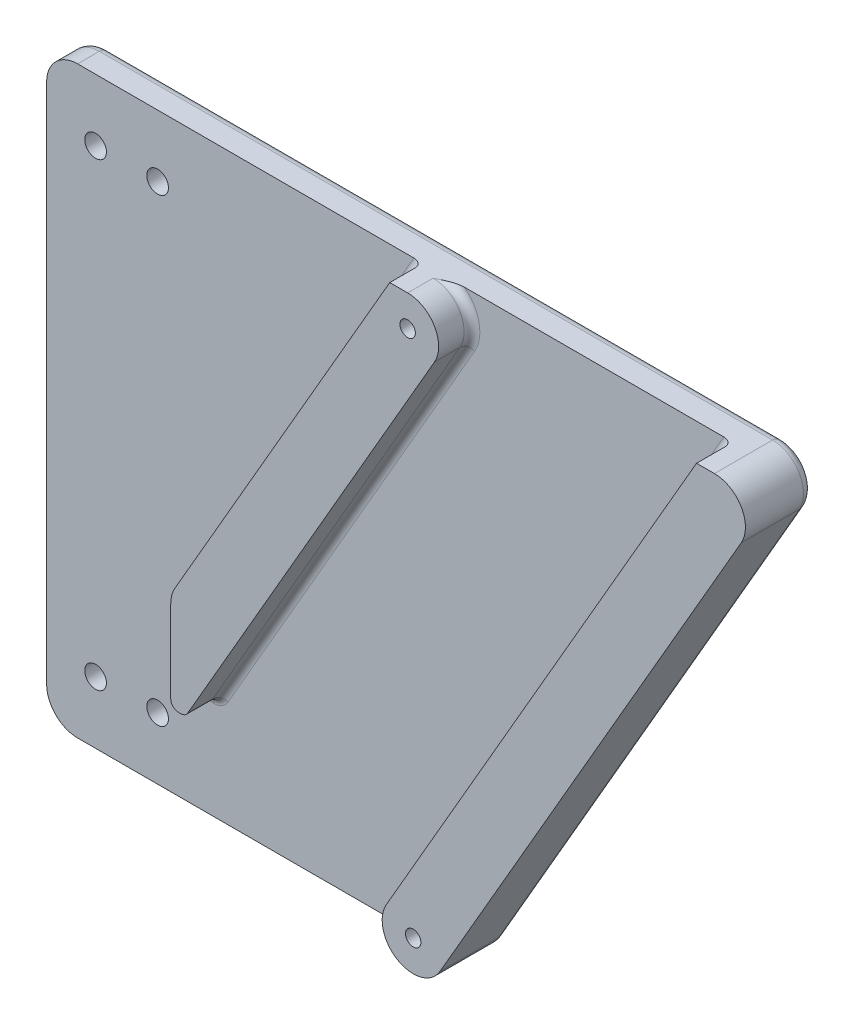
ISO-10303-21;
HEADER;
FILE_DESCRIPTION(('STEP AP214'),'2;1');
FILE_NAME('part.step','',(''),(''),'','','');
FILE_SCHEMA(('AUTOMOTIVE_DESIGN { 1 0 10303 214 1 1 1 1 }'));
ENDSEC;
DATA;
#1=APPLICATION_CONTEXT('core data for automotive mechanical design processes');
#2=APPLICATION_PROTOCOL_DEFINITION('international standard','automotive_design',2000,#1);
#3=PRODUCT_CONTEXT('',#1,'mechanical');
#4=PRODUCT('Part','Part','',(#3));
#5=PRODUCT_RELATED_PRODUCT_CATEGORY('part','',(#4));
#6=PRODUCT_DEFINITION_FORMATION('','',#4);
#7=PRODUCT_DEFINITION_CONTEXT('part definition',#1,'design');
#8=PRODUCT_DEFINITION('design','',#6,#7);
#9=PRODUCT_DEFINITION_SHAPE('','',#8);
#10=(LENGTH_UNIT() NAMED_UNIT(*) SI_UNIT(.MILLI.,.METRE.));
#11=(NAMED_UNIT(*) PLANE_ANGLE_UNIT() SI_UNIT($,.RADIAN.));
#12=(NAMED_UNIT(*) SI_UNIT($,.STERADIAN.) SOLID_ANGLE_UNIT());
#13=UNCERTAINTY_MEASURE_WITH_UNIT(LENGTH_MEASURE(1.E-05),#10,'distance_accuracy_value','');
#14=(GEOMETRIC_REPRESENTATION_CONTEXT(3) GLOBAL_UNCERTAINTY_ASSIGNED_CONTEXT((#13)) GLOBAL_UNIT_ASSIGNED_CONTEXT((#10,
#11,#12)) REPRESENTATION_CONTEXT('',''));
#15=CARTESIAN_POINT('',(0.,0.,0.));
#16=DIRECTION('',(0.,0.,1.));
#17=DIRECTION('',(1.,0.,0.));
#18=AXIS2_PLACEMENT_3D('',#15,#16,#17);
#19=CARTESIAN_POINT('',(0.,0.,10.));
#20=DIRECTION('',(0.,0.,1.));
#21=DIRECTION('',(1.,0.,0.));
#22=AXIS2_PLACEMENT_3D('',#19,#20,#21);
#23=PLANE('',#22);
#24=CARTESIAN_POINT('',(114.999999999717,74.1999999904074,10.));
#25=DIRECTION('',(0.,0.,1.));
#26=DIRECTION('',(1.,0.,0.));
#27=AXIS2_PLACEMENT_3D('',#24,#25,#26);
#28=CIRCLE('',#27,3.50000000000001);
#29=CARTESIAN_POINT('',(118.499999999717,74.1999999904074,10.));
#30=VERTEX_POINT('',#29);
#31=EDGE_CURVE('E303',#30,#30,#28,.T.);
#32=ORIENTED_EDGE('',*,*,#31,.F.);
#33=EDGE_LOOP('',(#32));
#34=FACE_BOUND('',#33,.T.);
#35=CARTESIAN_POINT('',(134.999999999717,74.1999999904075,10.));
#36=DIRECTION('',(0.,0.,1.));
#37=DIRECTION('',(1.,0.,0.));
#38=AXIS2_PLACEMENT_3D('',#35,#36,#37);
#39=CIRCLE('',#38,3.50000000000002);
#40=CARTESIAN_POINT('',(138.499999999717,74.1999999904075,10.));
#41=VERTEX_POINT('',#40);
#42=EDGE_CURVE('E306',#41,#41,#39,.T.);
#43=ORIENTED_EDGE('',*,*,#42,.F.);
#44=EDGE_LOOP('',(#43));
#45=FACE_BOUND('',#44,.T.);
#46=CARTESIAN_POINT('',(115.000000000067,-74.1999999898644,10.));
#47=DIRECTION('',(0.,0.,1.));
#48=DIRECTION('',(1.,0.,0.));
#49=AXIS2_PLACEMENT_3D('',#46,#47,#48);
#50=CIRCLE('',#49,3.49999999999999);
#51=CARTESIAN_POINT('',(118.500000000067,-74.1999999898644,10.));
#52=VERTEX_POINT('',#51);
#53=EDGE_CURVE('E309',#52,#52,#50,.T.);
#54=ORIENTED_EDGE('',*,*,#53,.F.);
#55=EDGE_LOOP('',(#54));
#56=FACE_BOUND('',#55,.T.);
#57=CARTESIAN_POINT('',(135.000000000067,-74.1999999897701,10.));
#58=DIRECTION('',(0.,0.,1.));
#59=DIRECTION('',(1.,0.,0.));
#60=AXIS2_PLACEMENT_3D('',#57,#58,#59);
#61=CIRCLE('',#60,3.49999999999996);
#62=CARTESIAN_POINT('',(138.500000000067,-74.1999999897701,10.));
#63=VERTEX_POINT('',#62);
#64=EDGE_CURVE('E312',#63,#63,#61,.T.);
#65=ORIENTED_EDGE('',*,*,#64,.F.);
#66=EDGE_LOOP('',(#65));
#67=FACE_BOUND('',#66,.T.);
#68=DIRECTION('',(1.,0.,0.));
#69=VECTOR('',#68,1.);
#70=CARTESIAN_POINT('',(0.,-94.2000000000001,10.));
#71=LINE('',#70,#69);
#72=CARTESIAN_POINT('',(109.2,-94.2000000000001,10.));
#73=VERTEX_POINT('',#72);
#74=CARTESIAN_POINT('',(221.660018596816,-94.2000000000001,10.));
#75=VERTEX_POINT('',#74);
#76=EDGE_CURVE('E300',#73,#75,#71,.T.);
#77=ORIENTED_EDGE('',*,*,#76,.T.);
#78=CARTESIAN_POINT('',(229.226497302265,-84.2000000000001,10.));
#79=DIRECTION('',(0.,0.,1.));
#80=DIRECTION('',(1.,0.,0.));
#81=AXIS2_PLACEMENT_3D('',#78,#79,#80);
#82=CIRCLE('',#81,12.54);
#83=CARTESIAN_POINT('',(218.366538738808,-77.9300000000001,10.));
#84=VERTEX_POINT('',#83);
#85=EDGE_CURVE('E458',#75,#84,#82,.F.);
#86=ORIENTED_EDGE('',*,*,#85,.T.);
#87=DIRECTION('',(0.499999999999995,0.866025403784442,0.));
#88=VECTOR('',#87,1.);
#89=CARTESIAN_POINT('',(197.519583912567,-114.037984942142,10.));
#90=LINE('',#89,#88);
#91=CARTESIAN_POINT('',(317.745840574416,94.2,10.));
#92=VERTEX_POINT('',#91);
#93=EDGE_CURVE('E456',#84,#92,#90,.T.);
#94=ORIENTED_EDGE('',*,*,#93,.T.);
#95=DIRECTION('',(1.,0.,0.));
#96=VECTOR('',#95,1.);
#97=CARTESIAN_POINT('',(0.,94.2,10.));
#98=LINE('',#97,#96);
#99=CARTESIAN_POINT('',(234.018761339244,94.2,10.));
#100=VERTEX_POINT('',#99);
#101=EDGE_CURVE('E297',#100,#92,#98,.T.);
#102=ORIENTED_EDGE('',*,*,#101,.F.);
#103=CARTESIAN_POINT('',(226.452282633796,84.2,10.));
#104=DIRECTION('',(0.,0.,1.));
#105=DIRECTION('',(1.,0.,0.));
#106=AXIS2_PLACEMENT_3D('',#103,#104,#105);
#107=CIRCLE('',#106,12.54);
#108=CARTESIAN_POINT('',(237.312241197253,77.93,10.));
#109=VERTEX_POINT('',#108);
#110=EDGE_CURVE('E453',#100,#109,#107,.F.);
#111=ORIENTED_EDGE('',*,*,#110,.T.);
#112=DIRECTION('',(-0.499999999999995,-0.866025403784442,0.));
#113=VECTOR('',#112,1.);
#114=CARTESIAN_POINT('',(157.678318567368,-60.000000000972,10.));
#115=LINE('',#114,#113);
#116=CARTESIAN_POINT('',(157.678318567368,-60.000000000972,10.));
#117=VERTEX_POINT('',#116);
#118=EDGE_CURVE('E451',#109,#117,#115,.T.);
#119=ORIENTED_EDGE('',*,*,#118,.T.);
#120=CARTESIAN_POINT('',(153.278909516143,-57.460000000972,10.));
#121=DIRECTION('',(0.,0.,1.));
#122=DIRECTION('',(1.,0.,0.));
#123=AXIS2_PLACEMENT_3D('',#120,#121,#122);
#124=CIRCLE('',#123,5.08);
#125=CARTESIAN_POINT('',(153.278909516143,-62.540000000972,10.));
#126=VERTEX_POINT('',#125);
#127=EDGE_CURVE('E449',#117,#126,#124,.F.);
#128=ORIENTED_EDGE('',*,*,#127,.T.);
#129=DIRECTION('',(1.,0.,0.));
#130=VECTOR('',#129,1.);
#131=CARTESIAN_POINT('',(0.,-62.540000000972,10.));
#132=LINE('',#131,#130);
#133=CARTESIAN_POINT('',(152.540000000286,-62.540000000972,10.));
#134=VERTEX_POINT('',#133);
#135=EDGE_CURVE('E447',#126,#134,#132,.F.);
#136=ORIENTED_EDGE('',*,*,#135,.T.);
#137=CARTESIAN_POINT('',(152.540000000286,-57.460000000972,10.));
#138=DIRECTION('',(0.,0.,1.));
#139=DIRECTION('',(1.,0.,0.));
#140=AXIS2_PLACEMENT_3D('',#137,#138,#139);
#141=CIRCLE('',#140,5.08);
#142=CARTESIAN_POINT('',(147.460000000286,-57.460000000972,10.));
#143=VERTEX_POINT('',#142);
#144=EDGE_CURVE('E445',#134,#143,#141,.F.);
#145=ORIENTED_EDGE('',*,*,#144,.T.);
#146=DIRECTION('',(0.,1.,0.));
#147=VECTOR('',#146,1.);
#148=CARTESIAN_POINT('',(147.460000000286,-30.8987298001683,10.));
#149=LINE('',#148,#147);
#150=CARTESIAN_POINT('',(147.460000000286,-30.8987298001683,10.));
#151=VERTEX_POINT('',#150);
#152=EDGE_CURVE('E443',#143,#151,#149,.T.);
#153=ORIENTED_EDGE('',*,*,#152,.T.);
#154=CARTESIAN_POINT('',(160.000000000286,-30.8987298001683,10.));
#155=DIRECTION('',(0.,0.,1.));
#156=DIRECTION('',(1.,0.,0.));
#157=AXIS2_PLACEMENT_3D('',#154,#155,#156);
#158=CIRCLE('',#157,12.54);
#159=CARTESIAN_POINT('',(149.140041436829,-24.6287298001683,10.));
#160=VERTEX_POINT('',#159);
#161=EDGE_CURVE('E441',#151,#160,#158,.F.);
#162=ORIENTED_EDGE('',*,*,#161,.T.);
#163=DIRECTION('',(-0.499999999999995,-0.866025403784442,0.));
#164=VECTOR('',#163,1.);
#165=CARTESIAN_POINT('',(122.519583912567,-70.7367147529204,10.));
#166=LINE('',#165,#164);
#167=CARTESIAN_POINT('',(217.745840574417,94.2,10.));
#168=VERTEX_POINT('',#167);
#169=EDGE_CURVE('E439',#160,#168,#166,.F.);
#170=ORIENTED_EDGE('',*,*,#169,.T.);
#171=CARTESIAN_POINT('',(109.2,94.2,10.));
#172=VERTEX_POINT('',#171);
#173=EDGE_CURVE('E294',#172,#168,#98,.T.);
#174=ORIENTED_EDGE('',*,*,#173,.F.);
#175=CARTESIAN_POINT('',(109.2,84.2,10.));
#176=DIRECTION('',(0.,0.,1.));
#177=DIRECTION('',(1.,0.,0.));
#178=AXIS2_PLACEMENT_3D('',#175,#176,#177);
#179=CIRCLE('',#178,10.);
#180=CARTESIAN_POINT('',(99.2,84.2,10.));
#181=VERTEX_POINT('',#180);
#182=EDGE_CURVE('E337',#172,#181,#179,.T.);
#183=ORIENTED_EDGE('',*,*,#182,.T.);
#184=DIRECTION('',(0.,-1.,0.));
#185=VECTOR('',#184,1.);
#186=CARTESIAN_POINT('',(99.2,0.,10.));
#187=LINE('',#186,#185);
#188=CARTESIAN_POINT('',(99.2,-84.2000000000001,10.));
#189=VERTEX_POINT('',#188);
#190=EDGE_CURVE('E296',#181,#189,#187,.T.);
#191=ORIENTED_EDGE('',*,*,#190,.T.);
#192=CARTESIAN_POINT('',(109.2,-84.2000000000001,10.));
#193=DIRECTION('',(0.,0.,1.));
#194=DIRECTION('',(1.,0.,0.));
#195=AXIS2_PLACEMENT_3D('',#192,#193,#194);
#196=CIRCLE('',#195,10.);
#197=EDGE_CURVE('E248',#189,#73,#196,.T.);
#198=ORIENTED_EDGE('',*,*,#197,.T.);
#199=EDGE_LOOP('',(#77,#86,#94,#102,#111,#119,#128,#136,#145,#153,#162,#170,#174,#183,#191,#198));
#200=FACE_BOUND('',#199,.T.);
#201=ADVANCED_FACE('F43',(#34,#45,#56,#67,#200),#23,.T.);
#202=CARTESIAN_POINT('',(0.,94.2,10.));
#203=DIRECTION('',(0.,1.,0.));
#204=DIRECTION('',(0.,0.,1.));
#205=AXIS2_PLACEMENT_3D('',#202,#203,#204);
#206=PLANE('',#205);
#207=DIRECTION('',(1.,0.,0.));
#208=VECTOR('',#207,1.);
#209=CARTESIAN_POINT('',(-4.41463060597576E-13,94.1999999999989,20.7520000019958));
#210=LINE('',#209,#208);
#211=CARTESIAN_POINT('',(220.6787799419,94.1999999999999,20.7520000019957));
#212=VERTEX_POINT('',#211);
#213=CARTESIAN_POINT('',(226.452282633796,94.1999999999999,20.7520000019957));
#214=VERTEX_POINT('',#213);
#215=EDGE_CURVE('E289',#212,#214,#210,.T.);
#216=ORIENTED_EDGE('',*,*,#215,.T.);
#217=DIRECTION('',(0.,0.,1.));
#218=VECTOR('',#217,1.);
#219=CARTESIAN_POINT('',(226.452282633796,94.2,9.99999999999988));
#220=LINE('',#219,#218);
#221=CARTESIAN_POINT('',(226.452282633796,94.2,12.54));
#222=VERTEX_POINT('',#221);
#223=EDGE_CURVE('E422',#214,#222,#220,.F.);
#224=ORIENTED_EDGE('',*,*,#223,.T.);
#225=CARTESIAN_POINT('',(234.018761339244,94.2,10.));
#226=CARTESIAN_POINT('',(233.885476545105,94.2,10.0000121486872));
#227=CARTESIAN_POINT('',(233.752231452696,94.2,10.0038186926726));
#228=CARTESIAN_POINT('',(233.486188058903,94.2,10.0183355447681));
#229=CARTESIAN_POINT('',(233.353389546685,94.2,10.0290419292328));
#230=CARTESIAN_POINT('',(233.088844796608,94.2,10.0566342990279));
#231=CARTESIAN_POINT('',(232.957096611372,94.2,10.0735019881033));
#232=CARTESIAN_POINT('',(232.694427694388,94.2,10.112829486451));
#233=CARTESIAN_POINT('',(232.563507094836,94.2,10.1352901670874));
#234=CARTESIAN_POINT('',(232.175669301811,94.2,10.209567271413));
#235=CARTESIAN_POINT('',(231.920133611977,94.2,10.2686793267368));
#236=CARTESIAN_POINT('',(231.413174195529,94.2,10.4028963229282));
#237=CARTESIAN_POINT('',(231.161754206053,94.2,10.4780150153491));
#238=CARTESIAN_POINT('',(230.527931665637,94.2,10.6853378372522));
#239=CARTESIAN_POINT('',(230.148444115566,94.2,10.8264066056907));
#240=CARTESIAN_POINT('',(229.398165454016,94.2,11.1296556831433));
#241=CARTESIAN_POINT('',(229.027375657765,94.2,11.2918391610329));
#242=CARTESIAN_POINT('',(227.921386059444,94.2,11.7996422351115));
#243=CARTESIAN_POINT('',(227.195606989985,94.2,12.1653766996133));
#244=CARTESIAN_POINT('',(226.464189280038,94.2,12.5339992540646));
#245=CARTESIAN_POINT('',(226.458235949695,94.2,12.5369996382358));
#246=CARTESIAN_POINT('',(226.452282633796,94.2,12.54));
#247=B_SPLINE_CURVE_WITH_KNOTS('',3,(#225,#226,#227,#228,#229,#230,#231,#232,#233,#234,#235,
#236,#237,#238,#239,#240,#241,#242,#243,#244,#245,#246),.UNSPECIFIED.,.F.,.F.,(4,2,2,2,2,2,2,2,
2,2,4),(0.,0.399742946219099,0.799258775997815,1.19759774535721,1.59599881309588,
2.38213648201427,3.16895227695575,4.38249668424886,5.59622342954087,8.03338627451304,
8.05338627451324),.UNSPECIFIED.);
#248=EDGE_CURVE('E490',#222,#100,#247,.F.);
#249=ORIENTED_EDGE('',*,*,#248,.T.);
#250=ORIENTED_EDGE('',*,*,#101,.T.);
#251=CARTESIAN_POINT('',(317.745840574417,94.2,12.54));
#252=DIRECTION('',(0.,1.,0.));
#253=DIRECTION('',(1.,0.,0.));
#254=AXIS2_PLACEMENT_3D('',#251,#252,#253);
#255=ELLIPSE('',#254,2.93293936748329,2.54);
#256=CARTESIAN_POINT('',(320.6787799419,94.2,12.54));
#257=VERTEX_POINT('',#256);
#258=EDGE_CURVE('E52',#92,#257,#255,.F.);
#259=ORIENTED_EDGE('',*,*,#258,.T.);
#260=DIRECTION('',(0.,0.,1.));
#261=VECTOR('',#260,1.);
#262=CARTESIAN_POINT('',(320.6787799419,94.2,7.43399999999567));
#263=LINE('',#262,#261);
#264=CARTESIAN_POINT('',(320.6787799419,94.2,21.7519999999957));
#265=VERTEX_POINT('',#264);
#266=EDGE_CURVE('E261',#257,#265,#263,.T.);
#267=ORIENTED_EDGE('',*,*,#266,.T.);
#268=DIRECTION('',(1.,0.,0.));
#269=VECTOR('',#268,1.);
#270=CARTESIAN_POINT('',(0.,94.2,21.7519999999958));
#271=LINE('',#270,#269);
#272=CARTESIAN_POINT('',(326.452282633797,94.2,21.7519999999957));
#273=VERTEX_POINT('',#272);
#274=EDGE_CURVE('E254',#265,#273,#271,.T.);
#275=ORIENTED_EDGE('',*,*,#274,.T.);
#276=DIRECTION('',(0.,0.,-1.));
#277=VECTOR('',#276,1.);
#278=CARTESIAN_POINT('',(326.452282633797,94.2,10.));
#279=LINE('',#278,#277);
#280=CARTESIAN_POINT('',(326.452282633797,94.2,3.));
#281=VERTEX_POINT('',#280);
#282=EDGE_CURVE('E237',#273,#281,#279,.T.);
#283=ORIENTED_EDGE('',*,*,#282,.T.);
#284=DIRECTION('',(1.,0.,0.));
#285=VECTOR('',#284,1.);
#286=CARTESIAN_POINT('',(109.2,94.2,3.));
#287=LINE('',#286,#285);
#288=CARTESIAN_POINT('',(109.2,94.2,3.));
#289=VERTEX_POINT('',#288);
#290=EDGE_CURVE('E380',#281,#289,#287,.F.);
#291=ORIENTED_EDGE('',*,*,#290,.T.);
#292=DIRECTION('',(0.,0.,-1.));
#293=VECTOR('',#292,1.);
#294=CARTESIAN_POINT('',(109.2,94.2,10.));
#295=LINE('',#294,#293);
#296=EDGE_CURVE('E247',#289,#172,#295,.F.);
#297=ORIENTED_EDGE('',*,*,#296,.T.);
#298=ORIENTED_EDGE('',*,*,#173,.T.);
#299=CARTESIAN_POINT('',(217.745840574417,94.2,12.54));
#300=DIRECTION('',(0.,1.,0.));
#301=DIRECTION('',(-1.,0.,0.));
#302=AXIS2_PLACEMENT_3D('',#299,#300,#301);
#303=ELLIPSE('',#302,2.93293936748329,2.54);
#304=CARTESIAN_POINT('',(220.6787799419,94.1999999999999,12.54));
#305=VERTEX_POINT('',#304);
#306=EDGE_CURVE('E11',#168,#305,#303,.F.);
#307=ORIENTED_EDGE('',*,*,#306,.T.);
#308=DIRECTION('',(0.,0.,1.));
#309=VECTOR('',#308,1.);
#310=CARTESIAN_POINT('',(220.6787799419,94.1999999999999,-170.474309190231));
#311=LINE('',#310,#309);
#312=EDGE_CURVE('E291',#305,#212,#311,.T.);
#313=ORIENTED_EDGE('',*,*,#312,.T.);
#314=EDGE_LOOP('',(#216,#224,#249,#250,#259,#267,#275,#283,#291,#297,#298,#307,#313));
#315=FACE_BOUND('',#314,.T.);
#316=ADVANCED_FACE('F260',(#315),#206,.T.);
#317=CARTESIAN_POINT('',(99.2,0.,10.));
#318=DIRECTION('',(1.,0.,0.));
#319=DIRECTION('',(0.,1.,0.));
#320=AXIS2_PLACEMENT_3D('',#317,#318,#319);
#321=PLANE('',#320);
#322=DIRECTION('',(0.,0.,-1.));
#323=VECTOR('',#322,1.);
#324=CARTESIAN_POINT('',(99.2,84.2,0.));
#325=LINE('',#324,#323);
#326=CARTESIAN_POINT('',(99.2,84.2,3.));
#327=VERTEX_POINT('',#326);
#328=EDGE_CURVE('E332',#181,#327,#325,.T.);
#329=ORIENTED_EDGE('',*,*,#328,.T.);
#330=DIRECTION('',(0.,-1.,0.));
#331=VECTOR('',#330,1.);
#332=CARTESIAN_POINT('',(99.2,0.,3.));
#333=LINE('',#332,#331);
#334=CARTESIAN_POINT('',(99.2,-84.2000000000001,3.));
#335=VERTEX_POINT('',#334);
#336=EDGE_CURVE('E376',#327,#335,#333,.T.);
#337=ORIENTED_EDGE('',*,*,#336,.T.);
#338=DIRECTION('',(0.,0.,-1.));
#339=VECTOR('',#338,1.);
#340=CARTESIAN_POINT('',(99.2,-84.2000000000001,10.));
#341=LINE('',#340,#339);
#342=EDGE_CURVE('E335',#335,#189,#341,.F.);
#343=ORIENTED_EDGE('',*,*,#342,.T.);
#344=ORIENTED_EDGE('',*,*,#190,.F.);
#345=EDGE_LOOP('',(#329,#337,#343,#344));
#346=FACE_BOUND('',#345,.T.);
#347=ADVANCED_FACE('F508',(#346),#321,.F.);
#348=CARTESIAN_POINT('',(0.,-94.2000000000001,10.));
#349=DIRECTION('',(0.,1.,0.));
#350=DIRECTION('',(0.,0.,1.));
#351=AXIS2_PLACEMENT_3D('',#348,#349,#350);
#352=PLANE('',#351);
#353=DIRECTION('',(0.,0.,-1.));
#354=VECTOR('',#353,1.);
#355=CARTESIAN_POINT('',(229.226497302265,-94.2000000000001,10.));
#356=LINE('',#355,#354);
#357=CARTESIAN_POINT('',(229.226497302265,-94.2000000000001,3.));
#358=VERTEX_POINT('',#357);
#359=CARTESIAN_POINT('',(229.226497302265,-94.2000000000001,12.54));
#360=VERTEX_POINT('',#359);
#361=EDGE_CURVE('E327',#358,#360,#356,.F.);
#362=ORIENTED_EDGE('',*,*,#361,.T.);
#363=CARTESIAN_POINT('',(221.660018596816,-94.2000000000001,10.));
#364=CARTESIAN_POINT('',(221.793303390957,-94.2000000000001,10.0000121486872));
#365=CARTESIAN_POINT('',(221.926548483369,-94.2000000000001,10.0038186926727));
#366=CARTESIAN_POINT('',(222.192591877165,-94.2000000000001,10.0183355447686));
#367=CARTESIAN_POINT('',(222.325390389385,-94.2000000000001,10.0290419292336));
#368=CARTESIAN_POINT('',(222.589935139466,-94.2000000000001,10.0566342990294));
#369=CARTESIAN_POINT('',(222.721683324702,-94.2000000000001,10.0735019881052));
#370=CARTESIAN_POINT('',(222.984352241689,-94.2000000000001,10.1128294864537));
#371=CARTESIAN_POINT('',(223.115272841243,-94.2000000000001,10.1352901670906));
#372=CARTESIAN_POINT('',(223.503110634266,-94.2000000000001,10.2095672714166));
#373=CARTESIAN_POINT('',(223.758646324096,-94.2000000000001,10.26867932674));
#374=CARTESIAN_POINT('',(224.265605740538,-94.2000000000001,10.4028963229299));
#375=CARTESIAN_POINT('',(224.517025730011,-94.2000000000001,10.4780150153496));
#376=CARTESIAN_POINT('',(225.150848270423,-94.2000000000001,10.6853378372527));
#377=CARTESIAN_POINT('',(225.530335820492,-94.2000000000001,10.8264066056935));
#378=CARTESIAN_POINT('',(226.280614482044,-94.2000000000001,11.1296556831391));
#379=CARTESIAN_POINT('',(226.651404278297,-94.2000000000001,11.2918391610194));
#380=CARTESIAN_POINT('',(227.757393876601,-94.2000000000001,11.7996422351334));
#381=CARTESIAN_POINT('',(228.483172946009,-94.2000000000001,12.1653766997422));
#382=CARTESIAN_POINT('',(229.214590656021,-94.2000000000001,12.5339992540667));
#383=CARTESIAN_POINT('',(229.220543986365,-94.2000000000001,12.5369996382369));
#384=CARTESIAN_POINT('',(229.226497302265,-94.2000000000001,12.54));
#385=B_SPLINE_CURVE_WITH_KNOTS('',3,(#363,#364,#365,#366,#367,#368,#369,#370,#371,#372,#373,
#374,#375,#376,#377,#378,#379,#380,#381,#382,#383,#384),.UNSPECIFIED.,.F.,.F.,(4,2,2,2,2,2,2,2,
2,2,4),(0.,0.399742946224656,0.799258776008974,1.19759774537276,1.59599881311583,
2.38213648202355,3.16895227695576,4.38249668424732,5.59622342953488,8.03338627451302,
8.0533862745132),.UNSPECIFIED.);
#386=EDGE_CURVE('E482',#360,#75,#385,.F.);
#387=ORIENTED_EDGE('',*,*,#386,.T.);
#388=ORIENTED_EDGE('',*,*,#76,.F.);
#389=DIRECTION('',(0.,0.,-1.));
#390=VECTOR('',#389,1.);
#391=CARTESIAN_POINT('',(109.2,-94.2000000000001,10.));
#392=LINE('',#391,#390);
#393=CARTESIAN_POINT('',(109.2,-94.2000000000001,3.));
#394=VERTEX_POINT('',#393);
#395=EDGE_CURVE('E329',#73,#394,#392,.T.);
#396=ORIENTED_EDGE('',*,*,#395,.T.);
#397=DIRECTION('',(1.,0.,0.));
#398=VECTOR('',#397,1.);
#399=CARTESIAN_POINT('',(0.,-94.2000000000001,3.));
#400=LINE('',#399,#398);
#401=EDGE_CURVE('E387',#394,#358,#400,.T.);
#402=ORIENTED_EDGE('',*,*,#401,.T.);
#403=EDGE_LOOP('',(#362,#387,#388,#396,#402));
#404=FACE_BOUND('',#403,.T.);
#405=ADVANCED_FACE('F502',(#404),#352,.F.);
#406=CARTESIAN_POINT('',(115.000000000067,-74.1999999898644,10.));
#407=DIRECTION('',(0.,0.,-1.));
#408=DIRECTION('',(-1.,0.,0.));
#409=AXIS2_PLACEMENT_3D('',#406,#407,#408);
#410=CYLINDRICAL_SURFACE('',#409,3.49999999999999);
#411=ORIENTED_EDGE('',*,*,#53,.T.);
#412=EDGE_LOOP('',(#411));
#413=FACE_BOUND('',#412,.T.);
#414=CARTESIAN_POINT('',(115.000000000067,-74.1999999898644,0.));
#415=DIRECTION('',(0.,0.,1.));
#416=DIRECTION('',(1.,0.,0.));
#417=AXIS2_PLACEMENT_3D('',#414,#415,#416);
#418=CIRCLE('',#417,3.49999999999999);
#419=CARTESIAN_POINT('',(118.500000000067,-74.1999999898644,0.));
#420=VERTEX_POINT('',#419);
#421=EDGE_CURVE('E321',#420,#420,#418,.T.);
#422=ORIENTED_EDGE('',*,*,#421,.F.);
#423=EDGE_LOOP('',(#422));
#424=FACE_BOUND('',#423,.T.);
#425=ADVANCED_FACE('F507',(#413,#424),#410,.F.);
#426=CARTESIAN_POINT('',(134.999999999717,74.1999999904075,10.));
#427=DIRECTION('',(0.,0.,-1.));
#428=DIRECTION('',(-1.,0.,0.));
#429=AXIS2_PLACEMENT_3D('',#426,#427,#428);
#430=CYLINDRICAL_SURFACE('',#429,3.50000000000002);
#431=ORIENTED_EDGE('',*,*,#42,.T.);
#432=EDGE_LOOP('',(#431));
#433=FACE_BOUND('',#432,.T.);
#434=CARTESIAN_POINT('',(134.999999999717,74.1999999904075,0.));
#435=DIRECTION('',(0.,0.,1.));
#436=DIRECTION('',(1.,0.,0.));
#437=AXIS2_PLACEMENT_3D('',#434,#435,#436);
#438=CIRCLE('',#437,3.50000000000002);
#439=CARTESIAN_POINT('',(138.499999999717,74.1999999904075,0.));
#440=VERTEX_POINT('',#439);
#441=EDGE_CURVE('E318',#440,#440,#438,.T.);
#442=ORIENTED_EDGE('',*,*,#441,.F.);
#443=EDGE_LOOP('',(#442));
#444=FACE_BOUND('',#443,.T.);
#445=ADVANCED_FACE('F612',(#433,#444),#430,.F.);
#446=CARTESIAN_POINT('',(114.999999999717,74.1999999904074,10.));
#447=DIRECTION('',(0.,0.,-1.));
#448=DIRECTION('',(-1.,0.,0.));
#449=AXIS2_PLACEMENT_3D('',#446,#447,#448);
#450=CYLINDRICAL_SURFACE('',#449,3.50000000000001);
#451=ORIENTED_EDGE('',*,*,#31,.T.);
#452=EDGE_LOOP('',(#451));
#453=FACE_BOUND('',#452,.T.);
#454=CARTESIAN_POINT('',(114.999999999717,74.1999999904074,0.));
#455=DIRECTION('',(0.,0.,1.));
#456=DIRECTION('',(1.,0.,0.));
#457=AXIS2_PLACEMENT_3D('',#454,#455,#456);
#458=CIRCLE('',#457,3.50000000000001);
#459=CARTESIAN_POINT('',(118.499999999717,74.1999999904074,0.));
#460=VERTEX_POINT('',#459);
#461=EDGE_CURVE('E293',#460,#460,#458,.T.);
#462=ORIENTED_EDGE('',*,*,#461,.F.);
#463=EDGE_LOOP('',(#462));
#464=FACE_BOUND('',#463,.T.);
#465=ADVANCED_FACE('F615',(#453,#464),#450,.F.);
#466=CARTESIAN_POINT('',(217.039796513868,-125.307984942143,10.));
#467=DIRECTION('',(0.86602540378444,-0.499999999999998,0.));
#468=DIRECTION('',(0.499999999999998,0.86602540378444,0.));
#469=AXIS2_PLACEMENT_3D('',#466,#467,#468);
#470=PLANE('',#469);
#471=DIRECTION('',(0.,0.,-1.));
#472=VECTOR('',#471,1.);
#473=CARTESIAN_POINT('',(237.886751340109,-89.2,0.));
#474=LINE('',#473,#472);
#475=CARTESIAN_POINT('',(237.886751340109,-89.2000000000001,21.7519999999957));
#476=VERTEX_POINT('',#475);
#477=CARTESIAN_POINT('',(237.886751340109,-89.2,3.));
#478=VERTEX_POINT('',#477);
#479=EDGE_CURVE('E343',#476,#478,#474,.T.);
#480=ORIENTED_EDGE('',*,*,#479,.T.);
#481=DIRECTION('',(-0.499999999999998,-0.86602540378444,0.));
#482=VECTOR('',#481,1.);
#483=CARTESIAN_POINT('',(335.112536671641,79.2000000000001,3.));
#484=LINE('',#483,#482);
#485=CARTESIAN_POINT('',(335.112536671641,79.2,3.));
#486=VERTEX_POINT('',#485);
#487=EDGE_CURVE('E383',#478,#486,#484,.F.);
#488=ORIENTED_EDGE('',*,*,#487,.T.);
#489=DIRECTION('',(0.,0.,-1.));
#490=VECTOR('',#489,1.);
#491=CARTESIAN_POINT('',(335.112536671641,79.2,10.));
#492=LINE('',#491,#490);
#493=CARTESIAN_POINT('',(335.11253667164,79.2000000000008,21.7519999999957));
#494=VERTEX_POINT('',#493);
#495=EDGE_CURVE('E341',#486,#494,#492,.F.);
#496=ORIENTED_EDGE('',*,*,#495,.T.);
#497=DIRECTION('',(0.499999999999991,0.866025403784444,0.));
#498=VECTOR('',#497,1.);
#499=CARTESIAN_POINT('',(217.039796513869,-125.307984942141,21.7519999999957));
#500=LINE('',#499,#498);
#501=EDGE_CURVE('E257',#476,#494,#500,.T.);
#502=ORIENTED_EDGE('',*,*,#501,.F.);
#503=EDGE_LOOP('',(#480,#488,#496,#502));
#504=FACE_BOUND('',#503,.T.);
#505=ADVANCED_FACE('F510',(#504),#470,.T.);
#506=CARTESIAN_POINT('',(135.000000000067,-74.1999999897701,10.));
#507=DIRECTION('',(0.,0.,-1.));
#508=DIRECTION('',(-1.,0.,0.));
#509=AXIS2_PLACEMENT_3D('',#506,#507,#508);
#510=CYLINDRICAL_SURFACE('',#509,3.49999999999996);
#511=ORIENTED_EDGE('',*,*,#64,.T.);
#512=EDGE_LOOP('',(#511));
#513=FACE_BOUND('',#512,.T.);
#514=CARTESIAN_POINT('',(135.000000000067,-74.1999999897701,0.));
#515=DIRECTION('',(0.,0.,1.));
#516=DIRECTION('',(1.,0.,0.));
#517=AXIS2_PLACEMENT_3D('',#514,#515,#516);
#518=CIRCLE('',#517,3.49999999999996);
#519=CARTESIAN_POINT('',(138.500000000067,-74.1999999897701,0.));
#520=VERTEX_POINT('',#519);
#521=EDGE_CURVE('E324',#520,#520,#518,.T.);
#522=ORIENTED_EDGE('',*,*,#521,.F.);
#523=EDGE_LOOP('',(#522));
#524=FACE_BOUND('',#523,.T.);
#525=ADVANCED_FACE('F605',(#513,#524),#510,.F.);
#526=CARTESIAN_POINT('',(0.,0.,0.));
#527=DIRECTION('',(0.,0.,1.));
#528=DIRECTION('',(1.,0.,0.));
#529=AXIS2_PLACEMENT_3D('',#526,#527,#528);
#530=PLANE('',#529);
#531=DIRECTION('',(1.,0.,0.));
#532=VECTOR('',#531,1.);
#533=CARTESIAN_POINT('',(0.,-91.2000000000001,0.));
#534=LINE('',#533,#532);
#535=CARTESIAN_POINT('',(229.226497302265,-91.2000000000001,0.));
#536=VERTEX_POINT('',#535);
#537=CARTESIAN_POINT('',(109.2,-91.2000000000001,0.));
#538=VERTEX_POINT('',#537);
#539=EDGE_CURVE('E353',#536,#538,#534,.F.);
#540=ORIENTED_EDGE('',*,*,#539,.T.);
#541=CARTESIAN_POINT('',(109.2,-84.2000000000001,0.));
#542=DIRECTION('',(0.,0.,1.));
#543=DIRECTION('',(1.,0.,0.));
#544=AXIS2_PLACEMENT_3D('',#541,#542,#543);
#545=CIRCLE('',#544,7.);
#546=CARTESIAN_POINT('',(102.2,-84.2000000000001,0.));
#547=VERTEX_POINT('',#546);
#548=EDGE_CURVE('E370',#538,#547,#545,.F.);
#549=ORIENTED_EDGE('',*,*,#548,.T.);
#550=DIRECTION('',(0.,-1.,0.));
#551=VECTOR('',#550,1.);
#552=CARTESIAN_POINT('',(102.2,0.,0.));
#553=LINE('',#552,#551);
#554=CARTESIAN_POINT('',(102.2,84.2,0.));
#555=VERTEX_POINT('',#554);
#556=EDGE_CURVE('E368',#547,#555,#553,.F.);
#557=ORIENTED_EDGE('',*,*,#556,.T.);
#558=CARTESIAN_POINT('',(109.2,84.2,0.));
#559=DIRECTION('',(0.,0.,1.));
#560=DIRECTION('',(1.,0.,0.));
#561=AXIS2_PLACEMENT_3D('',#558,#559,#560);
#562=CIRCLE('',#561,7.);
#563=CARTESIAN_POINT('',(109.2,91.2,0.));
#564=VERTEX_POINT('',#563);
#565=EDGE_CURVE('E366',#555,#564,#562,.F.);
#566=ORIENTED_EDGE('',*,*,#565,.T.);
#567=DIRECTION('',(1.,0.,0.));
#568=VECTOR('',#567,1.);
#569=CARTESIAN_POINT('',(326.452282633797,91.2,0.));
#570=LINE('',#569,#568);
#571=CARTESIAN_POINT('',(326.452282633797,91.2,0.));
#572=VERTEX_POINT('',#571);
#573=EDGE_CURVE('E364',#564,#572,#570,.T.);
#574=ORIENTED_EDGE('',*,*,#573,.T.);
#575=CARTESIAN_POINT('',(326.452282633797,84.2,0.));
#576=DIRECTION('',(0.,0.,1.));
#577=DIRECTION('',(1.,0.,0.));
#578=AXIS2_PLACEMENT_3D('',#575,#576,#577);
#579=CIRCLE('',#578,7.);
#580=CARTESIAN_POINT('',(332.514460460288,80.7,0.));
#581=VERTEX_POINT('',#580);
#582=EDGE_CURVE('E362',#572,#581,#579,.F.);
#583=ORIENTED_EDGE('',*,*,#582,.T.);
#584=DIRECTION('',(-0.499999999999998,-0.86602540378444,0.));
#585=VECTOR('',#584,1.);
#586=CARTESIAN_POINT('',(235.288675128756,-87.7000000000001,0.));
#587=LINE('',#586,#585);
#588=CARTESIAN_POINT('',(235.288675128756,-87.7000000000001,0.));
#589=VERTEX_POINT('',#588);
#590=EDGE_CURVE('E360',#581,#589,#587,.T.);
#591=ORIENTED_EDGE('',*,*,#590,.T.);
#592=CARTESIAN_POINT('',(229.226497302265,-84.2000000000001,0.));
#593=DIRECTION('',(0.,0.,1.));
#594=DIRECTION('',(1.,0.,0.));
#595=AXIS2_PLACEMENT_3D('',#592,#593,#594);
#596=CIRCLE('',#595,7.);
#597=EDGE_CURVE('E358',#589,#536,#596,.F.);
#598=ORIENTED_EDGE('',*,*,#597,.T.);
#599=EDGE_LOOP('',(#540,#549,#557,#566,#574,#583,#591,#598));
#600=FACE_BOUND('',#599,.T.);
#601=CARTESIAN_POINT('',(226.452282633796,84.1999999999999,0.));
#602=DIRECTION('',(0.,0.,1.));
#603=DIRECTION('',(1.,0.,0.));
#604=AXIS2_PLACEMENT_3D('',#601,#602,#603);
#605=CIRCLE('',#604,2.48919999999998);
#606=CARTESIAN_POINT('',(228.941482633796,84.1999999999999,0.));
#607=VERTEX_POINT('',#606);
#608=EDGE_CURVE('E263',#607,#607,#605,.T.);
#609=ORIENTED_EDGE('',*,*,#608,.T.);
#610=EDGE_LOOP('',(#609));
#611=FACE_BOUND('',#610,.T.);
#612=CARTESIAN_POINT('',(229.226497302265,-84.2000000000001,0.));
#613=DIRECTION('',(0.,0.,1.));
#614=DIRECTION('',(1.,0.,0.));
#615=AXIS2_PLACEMENT_3D('',#612,#613,#614);
#616=CIRCLE('',#615,2.4892);
#617=CARTESIAN_POINT('',(231.715697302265,-84.2000000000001,0.));
#618=VERTEX_POINT('',#617);
#619=EDGE_CURVE('E356',#618,#618,#616,.T.);
#620=ORIENTED_EDGE('',*,*,#619,.T.);
#621=EDGE_LOOP('',(#620));
#622=FACE_BOUND('',#621,.T.);
#623=ORIENTED_EDGE('',*,*,#461,.T.);
#624=EDGE_LOOP('',(#623));
#625=FACE_BOUND('',#624,.T.);
#626=ORIENTED_EDGE('',*,*,#441,.T.);
#627=EDGE_LOOP('',(#626));
#628=FACE_BOUND('',#627,.T.);
#629=ORIENTED_EDGE('',*,*,#421,.T.);
#630=EDGE_LOOP('',(#629));
#631=FACE_BOUND('',#630,.T.);
#632=ORIENTED_EDGE('',*,*,#521,.T.);
#633=EDGE_LOOP('',(#632));
#634=FACE_BOUND('',#633,.T.);
#635=ADVANCED_FACE('F521',(#600,#611,#622,#625,#628,#631,#634),#530,.F.);
#636=CARTESIAN_POINT('',(109.2,-84.2000000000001,10.));
#637=DIRECTION('',(0.,0.,-1.));
#638=DIRECTION('',(-1.,0.,0.));
#639=AXIS2_PLACEMENT_3D('',#636,#637,#638);
#640=CYLINDRICAL_SURFACE('',#639,10.);
#641=ORIENTED_EDGE('',*,*,#342,.F.);
#642=CARTESIAN_POINT('',(109.2,-84.2000000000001,3.));
#643=DIRECTION('',(0.,0.,1.));
#644=DIRECTION('',(1.,0.,0.));
#645=AXIS2_PLACEMENT_3D('',#642,#643,#644);
#646=CIRCLE('',#645,10.);
#647=EDGE_CURVE('E373',#335,#394,#646,.T.);
#648=ORIENTED_EDGE('',*,*,#647,.T.);
#649=ORIENTED_EDGE('',*,*,#395,.F.);
#650=ORIENTED_EDGE('',*,*,#197,.F.);
#651=EDGE_LOOP('',(#641,#648,#649,#650));
#652=FACE_BOUND('',#651,.T.);
#653=ADVANCED_FACE('F517',(#652),#640,.T.);
#654=CARTESIAN_POINT('',(109.2,84.2,10.));
#655=DIRECTION('',(0.,0.,1.));
#656=DIRECTION('',(1.,0.,0.));
#657=AXIS2_PLACEMENT_3D('',#654,#655,#656);
#658=CYLINDRICAL_SURFACE('',#657,10.);
#659=ORIENTED_EDGE('',*,*,#296,.F.);
#660=CARTESIAN_POINT('',(109.2,84.2,3.));
#661=DIRECTION('',(0.,0.,1.));
#662=DIRECTION('',(1.,0.,0.));
#663=AXIS2_PLACEMENT_3D('',#660,#661,#662);
#664=CIRCLE('',#663,10.);
#665=EDGE_CURVE('E378',#289,#327,#664,.T.);
#666=ORIENTED_EDGE('',*,*,#665,.T.);
#667=ORIENTED_EDGE('',*,*,#328,.F.);
#668=ORIENTED_EDGE('',*,*,#182,.F.);
#669=EDGE_LOOP('',(#659,#666,#667,#668));
#670=FACE_BOUND('',#669,.T.);
#671=ADVANCED_FACE('F520',(#670),#658,.T.);
#672=CARTESIAN_POINT('',(229.226497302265,-84.2000000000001,10.));
#673=DIRECTION('',(0.,0.,1.));
#674=DIRECTION('',(1.,0.,0.));
#675=AXIS2_PLACEMENT_3D('',#672,#673,#674);
#676=CYLINDRICAL_SURFACE('',#675,10.);
#677=ORIENTED_EDGE('',*,*,#361,.F.);
#678=CARTESIAN_POINT('',(229.226497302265,-84.2000000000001,3.));
#679=DIRECTION('',(0.,0.,1.));
#680=DIRECTION('',(1.,0.,0.));
#681=AXIS2_PLACEMENT_3D('',#678,#679,#680);
#682=CIRCLE('',#681,10.);
#683=EDGE_CURVE('E385',#358,#478,#682,.T.);
#684=ORIENTED_EDGE('',*,*,#683,.T.);
#685=ORIENTED_EDGE('',*,*,#479,.F.);
#686=CARTESIAN_POINT('',(229.226497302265,-84.2000000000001,21.7519999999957));
#687=DIRECTION('',(0.,0.,-1.));
#688=DIRECTION('',(-1.,0.,0.));
#689=AXIS2_PLACEMENT_3D('',#686,#687,#688);
#690=CIRCLE('',#689,10.);
#691=CARTESIAN_POINT('',(229.226497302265,-94.2000000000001,21.7519999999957));
#692=VERTEX_POINT('',#691);
#693=EDGE_CURVE('E271',#476,#692,#690,.T.);
#694=ORIENTED_EDGE('',*,*,#693,.T.);
#695=EDGE_CURVE('E315',#360,#692,#356,.F.);
#696=ORIENTED_EDGE('',*,*,#695,.F.);
#697=EDGE_LOOP('',(#677,#684,#685,#694,#696));
#698=FACE_BOUND('',#697,.T.);
#699=ADVANCED_FACE('F525',(#698),#676,.T.);
#700=CARTESIAN_POINT('',(326.452282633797,84.2,10.));
#701=DIRECTION('',(0.,0.,-1.));
#702=DIRECTION('',(-1.,0.,0.));
#703=AXIS2_PLACEMENT_3D('',#700,#701,#702);
#704=CYLINDRICAL_SURFACE('',#703,10.);
#705=ORIENTED_EDGE('',*,*,#495,.F.);
#706=CARTESIAN_POINT('',(326.452282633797,84.2,3.));
#707=DIRECTION('',(0.,0.,1.));
#708=DIRECTION('',(1.,0.,0.));
#709=AXIS2_PLACEMENT_3D('',#706,#707,#708);
#710=CIRCLE('',#709,10.);
#711=EDGE_CURVE('E244',#486,#281,#710,.T.);
#712=ORIENTED_EDGE('',*,*,#711,.T.);
#713=ORIENTED_EDGE('',*,*,#282,.F.);
#714=CARTESIAN_POINT('',(326.452282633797,84.2,21.7519999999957));
#715=DIRECTION('',(0.,0.,-1.));
#716=DIRECTION('',(-1.,0.,0.));
#717=AXIS2_PLACEMENT_3D('',#714,#715,#716);
#718=CIRCLE('',#717,10.);
#719=EDGE_CURVE('E241',#273,#494,#718,.T.);
#720=ORIENTED_EDGE('',*,*,#719,.T.);
#721=EDGE_LOOP('',(#705,#712,#713,#720));
#722=FACE_BOUND('',#721,.T.);
#723=ADVANCED_FACE('F240',(#722),#704,.T.);
#724=CARTESIAN_POINT('',(0.,0.,20.7520000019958));
#725=DIRECTION('',(0.,0.,-1.));
#726=DIRECTION('',(-1.,0.,0.));
#727=AXIS2_PLACEMENT_3D('',#724,#725,#726);
#728=PLANE('',#727);
#729=CARTESIAN_POINT('',(226.452282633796,84.1999999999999,20.7520000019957));
#730=DIRECTION('',(0.,0.,-1.));
#731=DIRECTION('',(-1.,0.,0.));
#732=AXIS2_PLACEMENT_3D('',#729,#730,#731);
#733=CIRCLE('',#732,2.48919999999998);
#734=CARTESIAN_POINT('',(223.963082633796,84.1999999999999,20.7520000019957));
#735=VERTEX_POINT('',#734);
#736=EDGE_CURVE('E266',#735,#735,#733,.T.);
#737=ORIENTED_EDGE('',*,*,#736,.T.);
#738=EDGE_LOOP('',(#737));
#739=FACE_BOUND('',#738,.T.);
#740=DIRECTION('',(-1.,0.,0.));
#741=VECTOR('',#740,1.);
#742=CARTESIAN_POINT('',(0.,-60.000000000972,20.7520000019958));
#743=LINE('',#742,#741);
#744=CARTESIAN_POINT('',(153.278909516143,-60.000000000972,20.7520000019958));
#745=VERTEX_POINT('',#744);
#746=CARTESIAN_POINT('',(152.540000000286,-60.000000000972,20.7520000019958));
#747=VERTEX_POINT('',#746);
#748=EDGE_CURVE('E280',#745,#747,#743,.T.);
#749=ORIENTED_EDGE('',*,*,#748,.F.);
#750=CARTESIAN_POINT('',(153.278909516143,-57.460000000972,20.7520000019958));
#751=DIRECTION('',(0.,0.,-1.));
#752=DIRECTION('',(-1.,0.,0.));
#753=AXIS2_PLACEMENT_3D('',#750,#751,#752);
#754=CIRCLE('',#753,2.54);
#755=CARTESIAN_POINT('',(155.478614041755,-58.730000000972,20.7520000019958));
#756=VERTEX_POINT('',#755);
#757=EDGE_CURVE('E432',#745,#756,#754,.F.);
#758=ORIENTED_EDGE('',*,*,#757,.T.);
#759=DIRECTION('',(0.499999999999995,0.866025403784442,0.));
#760=VECTOR('',#759,1.);
#761=CARTESIAN_POINT('',(142.039796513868,-82.0067147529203,20.7520000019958));
#762=LINE('',#761,#760);
#763=CARTESIAN_POINT('',(235.112536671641,79.2000000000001,20.7520000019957));
#764=VERTEX_POINT('',#763);
#765=EDGE_CURVE('E277',#756,#764,#762,.T.);
#766=ORIENTED_EDGE('',*,*,#765,.T.);
#767=CARTESIAN_POINT('',(226.452282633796,84.2,20.7520000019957));
#768=DIRECTION('',(0.,0.,-1.));
#769=DIRECTION('',(-1.,0.,0.));
#770=AXIS2_PLACEMENT_3D('',#767,#768,#769);
#771=CIRCLE('',#770,10.);
#772=EDGE_CURVE('E420',#764,#214,#771,.F.);
#773=ORIENTED_EDGE('',*,*,#772,.T.);
#774=ORIENTED_EDGE('',*,*,#215,.F.);
#775=DIRECTION('',(0.499999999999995,0.866025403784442,0.));
#776=VECTOR('',#775,1.);
#777=CARTESIAN_POINT('',(124.719288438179,-72.0067147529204,20.7520000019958));
#778=LINE('',#777,#776);
#779=CARTESIAN_POINT('',(151.339745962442,-25.8987298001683,20.7520000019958));
#780=VERTEX_POINT('',#779);
#781=EDGE_CURVE('E286',#780,#212,#778,.T.);
#782=ORIENTED_EDGE('',*,*,#781,.F.);
#783=CARTESIAN_POINT('',(160.000000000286,-30.8987298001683,20.7520000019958));
#784=DIRECTION('',(0.,0.,-1.));
#785=DIRECTION('',(-1.,0.,0.));
#786=AXIS2_PLACEMENT_3D('',#783,#784,#785);
#787=CIRCLE('',#786,10.);
#788=CARTESIAN_POINT('',(150.000000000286,-30.8987298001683,20.7520000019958));
#789=VERTEX_POINT('',#788);
#790=EDGE_CURVE('E348',#780,#789,#787,.F.);
#791=ORIENTED_EDGE('',*,*,#790,.T.);
#792=DIRECTION('',(0.,-1.,0.));
#793=VECTOR('',#792,1.);
#794=CARTESIAN_POINT('',(150.000000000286,0.,20.7520000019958));
#795=LINE('',#794,#793);
#796=CARTESIAN_POINT('',(150.000000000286,-57.460000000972,20.7520000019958));
#797=VERTEX_POINT('',#796);
#798=EDGE_CURVE('E283',#789,#797,#795,.T.);
#799=ORIENTED_EDGE('',*,*,#798,.T.);
#800=CARTESIAN_POINT('',(152.540000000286,-57.460000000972,20.7520000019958));
#801=DIRECTION('',(0.,0.,-1.));
#802=DIRECTION('',(-1.,0.,0.));
#803=AXIS2_PLACEMENT_3D('',#800,#801,#802);
#804=CIRCLE('',#803,2.54);
#805=EDGE_CURVE('E430',#797,#747,#804,.F.);
#806=ORIENTED_EDGE('',*,*,#805,.T.);
#807=EDGE_LOOP('',(#749,#758,#766,#773,#774,#782,#791,#799,#806));
#808=FACE_BOUND('',#807,.T.);
#809=ADVANCED_FACE('F532',(#739,#808),#728,.F.);
#810=CARTESIAN_POINT('',(124.719288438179,-72.0067147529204,-170.474309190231));
#811=DIRECTION('',(0.866025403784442,-0.499999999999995,0.));
#812=DIRECTION('',(0.499999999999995,0.866025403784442,0.));
#813=AXIS2_PLACEMENT_3D('',#810,#811,#812);
#814=PLANE('',#813);
#815=ORIENTED_EDGE('',*,*,#312,.F.);
#816=DIRECTION('',(-0.499999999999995,-0.866025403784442,0.));
#817=VECTOR('',#816,1.);
#818=CARTESIAN_POINT('',(124.719288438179,-72.0067147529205,12.54));
#819=LINE('',#818,#817);
#820=CARTESIAN_POINT('',(151.339745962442,-25.8987298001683,12.54));
#821=VERTEX_POINT('',#820);
#822=EDGE_CURVE('E480',#305,#821,#819,.T.);
#823=ORIENTED_EDGE('',*,*,#822,.T.);
#824=DIRECTION('',(0.,0.,1.));
#825=VECTOR('',#824,1.);
#826=CARTESIAN_POINT('',(151.339745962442,-25.8987298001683,20.7520000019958));
#827=LINE('',#826,#825);
#828=EDGE_CURVE('E346',#821,#780,#827,.T.);
#829=ORIENTED_EDGE('',*,*,#828,.T.);
#830=ORIENTED_EDGE('',*,*,#781,.T.);
#831=EDGE_LOOP('',(#815,#823,#829,#830));
#832=FACE_BOUND('',#831,.T.);
#833=ADVANCED_FACE('F738',(#832),#814,.F.);
#834=CARTESIAN_POINT('',(150.000000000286,0.,-170.474309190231));
#835=DIRECTION('',(-1.,0.,0.));
#836=DIRECTION('',(0.,0.,1.));
#837=AXIS2_PLACEMENT_3D('',#834,#835,#836);
#838=PLANE('',#837);
#839=DIRECTION('',(0.,0.,1.));
#840=VECTOR('',#839,1.);
#841=CARTESIAN_POINT('',(150.000000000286,-30.8987298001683,10.));
#842=LINE('',#841,#840);
#843=CARTESIAN_POINT('',(150.000000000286,-30.8987298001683,12.54));
#844=VERTEX_POINT('',#843);
#845=EDGE_CURVE('E350',#789,#844,#842,.F.);
#846=ORIENTED_EDGE('',*,*,#845,.T.);
#847=DIRECTION('',(0.,1.,0.));
#848=VECTOR('',#847,1.);
#849=CARTESIAN_POINT('',(150.000000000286,-57.460000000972,12.54));
#850=LINE('',#849,#848);
#851=CARTESIAN_POINT('',(150.000000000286,-57.460000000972,12.54));
#852=VERTEX_POINT('',#851);
#853=EDGE_CURVE('E474',#844,#852,#850,.F.);
#854=ORIENTED_EDGE('',*,*,#853,.T.);
#855=DIRECTION('',(0.,0.,1.));
#856=VECTOR('',#855,1.);
#857=CARTESIAN_POINT('',(150.000000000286,-57.460000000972,20.7520000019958));
#858=LINE('',#857,#856);
#859=EDGE_CURVE('E437',#852,#797,#858,.T.);
#860=ORIENTED_EDGE('',*,*,#859,.T.);
#861=ORIENTED_EDGE('',*,*,#798,.F.);
#862=EDGE_LOOP('',(#846,#854,#860,#861));
#863=FACE_BOUND('',#862,.T.);
#864=ADVANCED_FACE('F735',(#863),#838,.T.);
#865=CARTESIAN_POINT('',(0.,-60.000000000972,-170.474309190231));
#866=DIRECTION('',(0.,1.,0.));
#867=DIRECTION('',(0.,0.,1.));
#868=AXIS2_PLACEMENT_3D('',#865,#866,#867);
#869=PLANE('',#868);
#870=DIRECTION('',(0.,0.,1.));
#871=VECTOR('',#870,1.);
#872=CARTESIAN_POINT('',(152.540000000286,-60.000000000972,10.));
#873=LINE('',#872,#871);
#874=CARTESIAN_POINT('',(152.540000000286,-60.000000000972,12.54));
#875=VERTEX_POINT('',#874);
#876=EDGE_CURVE('E425',#747,#875,#873,.F.);
#877=ORIENTED_EDGE('',*,*,#876,.T.);
#878=DIRECTION('',(1.,0.,0.));
#879=VECTOR('',#878,1.);
#880=CARTESIAN_POINT('',(0.,-60.000000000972,12.54));
#881=LINE('',#880,#879);
#882=CARTESIAN_POINT('',(153.278909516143,-60.000000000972,12.54));
#883=VERTEX_POINT('',#882);
#884=EDGE_CURVE('E470',#875,#883,#881,.T.);
#885=ORIENTED_EDGE('',*,*,#884,.T.);
#886=DIRECTION('',(0.,0.,1.));
#887=VECTOR('',#886,1.);
#888=CARTESIAN_POINT('',(153.278909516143,-60.000000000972,20.7520000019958));
#889=LINE('',#888,#887);
#890=EDGE_CURVE('E428',#883,#745,#889,.T.);
#891=ORIENTED_EDGE('',*,*,#890,.T.);
#892=ORIENTED_EDGE('',*,*,#748,.T.);
#893=EDGE_LOOP('',(#877,#885,#891,#892));
#894=FACE_BOUND('',#893,.T.);
#895=ADVANCED_FACE('F724',(#894),#869,.F.);
#896=CARTESIAN_POINT('',(142.039796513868,-82.0067147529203,-170.474309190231));
#897=DIRECTION('',(0.866025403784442,-0.499999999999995,0.));
#898=DIRECTION('',(0.499999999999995,0.866025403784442,0.));
#899=AXIS2_PLACEMENT_3D('',#896,#897,#898);
#900=PLANE('',#899);
#901=DIRECTION('',(0.,0.,1.));
#902=VECTOR('',#901,1.);
#903=CARTESIAN_POINT('',(155.478614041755,-58.730000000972,10.));
#904=LINE('',#903,#902);
#905=CARTESIAN_POINT('',(155.478614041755,-58.730000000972,12.54));
#906=VERTEX_POINT('',#905);
#907=EDGE_CURVE('E434',#756,#906,#904,.F.);
#908=ORIENTED_EDGE('',*,*,#907,.T.);
#909=DIRECTION('',(-0.499999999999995,-0.866025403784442,0.));
#910=VECTOR('',#909,1.);
#911=CARTESIAN_POINT('',(235.112536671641,79.2000000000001,12.54));
#912=LINE('',#911,#910);
#913=CARTESIAN_POINT('',(235.112536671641,79.2,12.54));
#914=VERTEX_POINT('',#913);
#915=EDGE_CURVE('E466',#906,#914,#912,.F.);
#916=ORIENTED_EDGE('',*,*,#915,.T.);
#917=DIRECTION('',(0.,0.,1.));
#918=VECTOR('',#917,1.);
#919=CARTESIAN_POINT('',(235.11253667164,79.2,-170.474309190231));
#920=LINE('',#919,#918);
#921=EDGE_CURVE('E418',#914,#764,#920,.T.);
#922=ORIENTED_EDGE('',*,*,#921,.T.);
#923=ORIENTED_EDGE('',*,*,#765,.F.);
#924=EDGE_LOOP('',(#908,#916,#922,#923));
#925=FACE_BOUND('',#924,.T.);
#926=ADVANCED_FACE('F537',(#925),#900,.T.);
#927=CARTESIAN_POINT('',(160.000000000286,-30.8987298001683,-170.474309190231));
#928=DIRECTION('',(0.,0.,-1.));
#929=DIRECTION('',(-1.,0.,0.));
#930=AXIS2_PLACEMENT_3D('',#927,#928,#929);
#931=CYLINDRICAL_SURFACE('',#930,10.);
#932=ORIENTED_EDGE('',*,*,#828,.F.);
#933=CARTESIAN_POINT('',(160.000000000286,-30.8987298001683,12.54));
#934=DIRECTION('',(0.,0.,1.));
#935=DIRECTION('',(1.,0.,0.));
#936=AXIS2_PLACEMENT_3D('',#933,#934,#935);
#937=CIRCLE('',#936,10.);
#938=EDGE_CURVE('E476',#821,#844,#937,.T.);
#939=ORIENTED_EDGE('',*,*,#938,.T.);
#940=ORIENTED_EDGE('',*,*,#845,.F.);
#941=ORIENTED_EDGE('',*,*,#790,.F.);
#942=EDGE_LOOP('',(#932,#939,#940,#941));
#943=FACE_BOUND('',#942,.T.);
#944=ADVANCED_FACE('F533',(#943),#931,.T.);
#945=CARTESIAN_POINT('',(199.71928843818,-115.307984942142,7.43399999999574));
#946=DIRECTION('',(0.866025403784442,-0.499999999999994,0.));
#947=DIRECTION('',(0.499999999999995,0.866025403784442,0.));
#948=AXIS2_PLACEMENT_3D('',#945,#946,#947);
#949=PLANE('',#948);
#950=ORIENTED_EDGE('',*,*,#266,.F.);
#951=DIRECTION('',(0.499999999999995,0.866025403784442,0.));
#952=VECTOR('',#951,1.);
#953=CARTESIAN_POINT('',(199.71928843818,-115.307984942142,12.54));
#954=LINE('',#953,#952);
#955=CARTESIAN_POINT('',(220.56624326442,-79.2000000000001,12.54));
#956=VERTEX_POINT('',#955);
#957=EDGE_CURVE('E478',#257,#956,#954,.F.);
#958=ORIENTED_EDGE('',*,*,#957,.T.);
#959=DIRECTION('',(0.,0.,1.));
#960=VECTOR('',#959,1.);
#961=CARTESIAN_POINT('',(220.56624326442,-79.2000000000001,7.43399999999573));
#962=LINE('',#961,#960);
#963=CARTESIAN_POINT('',(220.56624326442,-79.2000000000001,21.7519999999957));
#964=VERTEX_POINT('',#963);
#965=EDGE_CURVE('E389',#956,#964,#962,.T.);
#966=ORIENTED_EDGE('',*,*,#965,.T.);
#967=DIRECTION('',(0.499999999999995,0.866025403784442,0.));
#968=VECTOR('',#967,1.);
#969=CARTESIAN_POINT('',(199.71928843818,-115.307984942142,21.7519999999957));
#970=LINE('',#969,#968);
#971=EDGE_CURVE('E274',#964,#265,#970,.T.);
#972=ORIENTED_EDGE('',*,*,#971,.T.);
#973=EDGE_LOOP('',(#950,#958,#966,#972));
#974=FACE_BOUND('',#973,.T.);
#975=ADVANCED_FACE('F536',(#974),#949,.F.);
#976=CARTESIAN_POINT('',(0.,0.,21.7519999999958));
#977=DIRECTION('',(0.,0.,-1.));
#978=DIRECTION('',(-1.,0.,0.));
#979=AXIS2_PLACEMENT_3D('',#976,#977,#978);
#980=PLANE('',#979);
#981=CARTESIAN_POINT('',(229.226497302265,-84.2000000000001,21.7519999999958));
#982=DIRECTION('',(0.,0.,1.));
#983=DIRECTION('',(1.,0.,0.));
#984=AXIS2_PLACEMENT_3D('',#981,#982,#983);
#985=CIRCLE('',#984,2.4892);
#986=CARTESIAN_POINT('',(231.715697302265,-84.2000000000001,21.7519999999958));
#987=VERTEX_POINT('',#986);
#988=EDGE_CURVE('E413',#987,#987,#985,.T.);
#989=ORIENTED_EDGE('',*,*,#988,.F.);
#990=EDGE_LOOP('',(#989));
#991=FACE_BOUND('',#990,.T.);
#992=ORIENTED_EDGE('',*,*,#971,.F.);
#993=CARTESIAN_POINT('',(229.226497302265,-84.2000000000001,21.7519999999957));
#994=DIRECTION('',(0.,0.,-1.));
#995=DIRECTION('',(-1.,0.,0.));
#996=AXIS2_PLACEMENT_3D('',#993,#994,#995);
#997=CIRCLE('',#996,10.);
#998=EDGE_CURVE('E415',#964,#692,#997,.F.);
#999=ORIENTED_EDGE('',*,*,#998,.T.);
#1000=ORIENTED_EDGE('',*,*,#693,.F.);
#1001=ORIENTED_EDGE('',*,*,#501,.T.);
#1002=ORIENTED_EDGE('',*,*,#719,.F.);
#1003=ORIENTED_EDGE('',*,*,#274,.F.);
#1004=EDGE_LOOP('',(#992,#999,#1000,#1001,#1002,#1003));
#1005=FACE_BOUND('',#1004,.T.);
#1006=ADVANCED_FACE('F253',(#991,#1005),#980,.F.);
#1007=CARTESIAN_POINT('',(229.226497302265,-84.2000000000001,-68.7480000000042));
#1008=DIRECTION('',(0.,0.,1.));
#1009=DIRECTION('',(1.,0.,0.));
#1010=AXIS2_PLACEMENT_3D('',#1007,#1008,#1009);
#1011=CYLINDRICAL_SURFACE('',#1010,2.4892);
#1012=ORIENTED_EDGE('',*,*,#988,.T.);
#1013=EDGE_LOOP('',(#1012));
#1014=FACE_BOUND('',#1013,.T.);
#1015=ORIENTED_EDGE('',*,*,#619,.F.);
#1016=EDGE_LOOP('',(#1015));
#1017=FACE_BOUND('',#1016,.T.);
#1018=ADVANCED_FACE('F870',(#1014,#1017),#1011,.F.);
#1019=CARTESIAN_POINT('',(226.452282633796,84.1999999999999,-68.7480000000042));
#1020=DIRECTION('',(0.,0.,1.));
#1021=DIRECTION('',(1.,0.,0.));
#1022=AXIS2_PLACEMENT_3D('',#1019,#1020,#1021);
#1023=CYLINDRICAL_SURFACE('',#1022,2.48919999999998);
#1024=ORIENTED_EDGE('',*,*,#736,.F.);
#1025=EDGE_LOOP('',(#1024));
#1026=FACE_BOUND('',#1025,.T.);
#1027=ORIENTED_EDGE('',*,*,#608,.F.);
#1028=EDGE_LOOP('',(#1027));
#1029=FACE_BOUND('',#1028,.T.);
#1030=ADVANCED_FACE('F571',(#1026,#1029),#1023,.F.);
#1031=CARTESIAN_POINT('',(326.452282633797,84.2,3.));
#1032=DIRECTION('',(0.,0.,1.));
#1033=DIRECTION('',(1.,0.,0.));
#1034=AXIS2_PLACEMENT_3D('',#1031,#1032,#1033);
#1035=TOROIDAL_SURFACE('',#1034,7.,3.);
#1036=CARTESIAN_POINT('',(326.452282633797,91.2,3.));
#1037=DIRECTION('',(-1.,0.,0.));
#1038=DIRECTION('',(0.,0.,1.));
#1039=AXIS2_PLACEMENT_3D('',#1036,#1037,#1038);
#1040=CIRCLE('',#1039,3.);
#1041=EDGE_CURVE('E407',#281,#572,#1040,.T.);
#1042=ORIENTED_EDGE('',*,*,#1041,.F.);
#1043=ORIENTED_EDGE('',*,*,#711,.F.);
#1044=CARTESIAN_POINT('',(332.514460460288,80.7,3.));
#1045=DIRECTION('',(-0.499999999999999,-0.866025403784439,0.));
#1046=DIRECTION('',(0.866025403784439,-0.499999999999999,0.));
#1047=AXIS2_PLACEMENT_3D('',#1044,#1045,#1046);
#1048=CIRCLE('',#1047,3.);
#1049=EDGE_CURVE('E410',#581,#486,#1048,.T.);
#1050=ORIENTED_EDGE('',*,*,#1049,.F.);
#1051=ORIENTED_EDGE('',*,*,#582,.F.);
#1052=EDGE_LOOP('',(#1042,#1043,#1050,#1051));
#1053=FACE_BOUND('',#1052,.T.);
#1054=ADVANCED_FACE('F567',(#1053),#1035,.T.);
#1055=CARTESIAN_POINT('',(214.441720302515,-123.807984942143,3.));
#1056=DIRECTION('',(0.499999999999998,0.86602540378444,0.));
#1057=DIRECTION('',(-0.86602540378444,0.499999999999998,0.));
#1058=AXIS2_PLACEMENT_3D('',#1055,#1056,#1057);
#1059=CYLINDRICAL_SURFACE('',#1058,3.);
#1060=ORIENTED_EDGE('',*,*,#1049,.T.);
#1061=ORIENTED_EDGE('',*,*,#487,.F.);
#1062=CARTESIAN_POINT('',(235.288675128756,-87.7000000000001,3.));
#1063=DIRECTION('',(-0.499999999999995,-0.866025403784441,0.));
#1064=DIRECTION('',(0.866025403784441,-0.499999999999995,0.));
#1065=AXIS2_PLACEMENT_3D('',#1062,#1063,#1064);
#1066=CIRCLE('',#1065,3.);
#1067=EDGE_CURVE('E404',#589,#478,#1066,.T.);
#1068=ORIENTED_EDGE('',*,*,#1067,.F.);
#1069=ORIENTED_EDGE('',*,*,#590,.F.);
#1070=EDGE_LOOP('',(#1060,#1061,#1068,#1069));
#1071=FACE_BOUND('',#1070,.T.);
#1072=ADVANCED_FACE('F563',(#1071),#1059,.T.);
#1073=CARTESIAN_POINT('',(0.,91.2,3.));
#1074=DIRECTION('',(-1.,0.,0.));
#1075=DIRECTION('',(0.,0.,1.));
#1076=AXIS2_PLACEMENT_3D('',#1073,#1074,#1075);
#1077=CYLINDRICAL_SURFACE('',#1076,3.);
#1078=ORIENTED_EDGE('',*,*,#1041,.T.);
#1079=ORIENTED_EDGE('',*,*,#573,.F.);
#1080=CARTESIAN_POINT('',(109.2,91.2,3.));
#1081=DIRECTION('',(-1.,0.,0.));
#1082=DIRECTION('',(0.,0.,1.));
#1083=AXIS2_PLACEMENT_3D('',#1080,#1081,#1082);
#1084=CIRCLE('',#1083,3.);
#1085=EDGE_CURVE('E401',#289,#564,#1084,.T.);
#1086=ORIENTED_EDGE('',*,*,#1085,.F.);
#1087=ORIENTED_EDGE('',*,*,#290,.F.);
#1088=EDGE_LOOP('',(#1078,#1079,#1086,#1087));
#1089=FACE_BOUND('',#1088,.T.);
#1090=ADVANCED_FACE('F559',(#1089),#1077,.T.);
#1091=CARTESIAN_POINT('',(229.226497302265,-84.2000000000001,3.));
#1092=DIRECTION('',(0.,0.,1.));
#1093=DIRECTION('',(1.,0.,0.));
#1094=AXIS2_PLACEMENT_3D('',#1091,#1092,#1093);
#1095=TOROIDAL_SURFACE('',#1094,7.,3.);
#1096=ORIENTED_EDGE('',*,*,#1067,.T.);
#1097=ORIENTED_EDGE('',*,*,#683,.F.);
#1098=CARTESIAN_POINT('',(229.226497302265,-91.2000000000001,3.));
#1099=DIRECTION('',(-1.,0.,0.));
#1100=DIRECTION('',(0.,0.,1.));
#1101=AXIS2_PLACEMENT_3D('',#1098,#1099,#1100);
#1102=CIRCLE('',#1101,3.);
#1103=EDGE_CURVE('E398',#536,#358,#1102,.T.);
#1104=ORIENTED_EDGE('',*,*,#1103,.F.);
#1105=ORIENTED_EDGE('',*,*,#597,.F.);
#1106=EDGE_LOOP('',(#1096,#1097,#1104,#1105));
#1107=FACE_BOUND('',#1106,.T.);
#1108=ADVANCED_FACE('F555',(#1107),#1095,.T.);
#1109=CARTESIAN_POINT('',(109.2,84.2,3.));
#1110=DIRECTION('',(0.,0.,1.));
#1111=DIRECTION('',(1.,0.,0.));
#1112=AXIS2_PLACEMENT_3D('',#1109,#1110,#1111);
#1113=TOROIDAL_SURFACE('',#1112,7.,3.);
#1114=ORIENTED_EDGE('',*,*,#1085,.T.);
#1115=ORIENTED_EDGE('',*,*,#565,.F.);
#1116=CARTESIAN_POINT('',(102.2,84.2,3.));
#1117=DIRECTION('',(0.,-1.,0.));
#1118=DIRECTION('',(0.,0.,-1.));
#1119=AXIS2_PLACEMENT_3D('',#1116,#1117,#1118);
#1120=CIRCLE('',#1119,3.);
#1121=EDGE_CURVE('E395',#327,#555,#1120,.T.);
#1122=ORIENTED_EDGE('',*,*,#1121,.F.);
#1123=ORIENTED_EDGE('',*,*,#665,.F.);
#1124=EDGE_LOOP('',(#1114,#1115,#1122,#1123));
#1125=FACE_BOUND('',#1124,.T.);
#1126=ADVANCED_FACE('F551',(#1125),#1113,.T.);
#1127=CARTESIAN_POINT('',(0.,-91.2000000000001,3.));
#1128=DIRECTION('',(1.,0.,0.));
#1129=DIRECTION('',(0.,0.,-1.));
#1130=AXIS2_PLACEMENT_3D('',#1127,#1128,#1129);
#1131=CYLINDRICAL_SURFACE('',#1130,3.);
#1132=ORIENTED_EDGE('',*,*,#1103,.T.);
#1133=ORIENTED_EDGE('',*,*,#401,.F.);
#1134=CARTESIAN_POINT('',(109.2,-91.2000000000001,3.));
#1135=DIRECTION('',(-1.,0.,0.));
#1136=DIRECTION('',(0.,0.,1.));
#1137=AXIS2_PLACEMENT_3D('',#1134,#1135,#1136);
#1138=CIRCLE('',#1137,3.);
#1139=EDGE_CURVE('E392',#538,#394,#1138,.T.);
#1140=ORIENTED_EDGE('',*,*,#1139,.F.);
#1141=ORIENTED_EDGE('',*,*,#539,.F.);
#1142=EDGE_LOOP('',(#1132,#1133,#1140,#1141));
#1143=FACE_BOUND('',#1142,.T.);
#1144=ADVANCED_FACE('F547',(#1143),#1131,.T.);
#1145=CARTESIAN_POINT('',(102.2,0.,3.));
#1146=DIRECTION('',(0.,-1.,0.));
#1147=DIRECTION('',(1.,0.,0.));
#1148=AXIS2_PLACEMENT_3D('',#1145,#1146,#1147);
#1149=CYLINDRICAL_SURFACE('',#1148,3.);
#1150=ORIENTED_EDGE('',*,*,#1121,.T.);
#1151=ORIENTED_EDGE('',*,*,#556,.F.);
#1152=CARTESIAN_POINT('',(102.2,-84.2000000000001,3.));
#1153=DIRECTION('',(0.,-1.,0.));
#1154=DIRECTION('',(0.,0.,-1.));
#1155=AXIS2_PLACEMENT_3D('',#1152,#1153,#1154);
#1156=CIRCLE('',#1155,3.);
#1157=EDGE_CURVE('E390',#335,#547,#1156,.T.);
#1158=ORIENTED_EDGE('',*,*,#1157,.F.);
#1159=ORIENTED_EDGE('',*,*,#336,.F.);
#1160=EDGE_LOOP('',(#1150,#1151,#1158,#1159));
#1161=FACE_BOUND('',#1160,.T.);
#1162=ADVANCED_FACE('F543',(#1161),#1149,.T.);
#1163=CARTESIAN_POINT('',(109.2,-84.2000000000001,3.));
#1164=DIRECTION('',(0.,0.,1.));
#1165=DIRECTION('',(1.,0.,0.));
#1166=AXIS2_PLACEMENT_3D('',#1163,#1164,#1165);
#1167=TOROIDAL_SURFACE('',#1166,7.,3.);
#1168=ORIENTED_EDGE('',*,*,#1139,.T.);
#1169=ORIENTED_EDGE('',*,*,#647,.F.);
#1170=ORIENTED_EDGE('',*,*,#1157,.T.);
#1171=ORIENTED_EDGE('',*,*,#548,.F.);
#1172=EDGE_LOOP('',(#1168,#1169,#1170,#1171));
#1173=FACE_BOUND('',#1172,.T.);
#1174=ADVANCED_FACE('F539',(#1173),#1167,.T.);
#1175=CARTESIAN_POINT('',(229.226497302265,-84.2000000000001,7.43399999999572));
#1176=DIRECTION('',(0.,0.,1.));
#1177=DIRECTION('',(1.,0.,0.));
#1178=AXIS2_PLACEMENT_3D('',#1175,#1176,#1177);
#1179=CYLINDRICAL_SURFACE('',#1178,10.);
#1180=ORIENTED_EDGE('',*,*,#965,.F.);
#1181=CARTESIAN_POINT('',(229.226497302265,-84.2000000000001,12.54));
#1182=DIRECTION('',(0.,0.,1.));
#1183=DIRECTION('',(1.,0.,0.));
#1184=AXIS2_PLACEMENT_3D('',#1181,#1182,#1183);
#1185=CIRCLE('',#1184,10.);
#1186=EDGE_CURVE('E461',#956,#360,#1185,.T.);
#1187=ORIENTED_EDGE('',*,*,#1186,.T.);
#1188=ORIENTED_EDGE('',*,*,#695,.T.);
#1189=ORIENTED_EDGE('',*,*,#998,.F.);
#1190=EDGE_LOOP('',(#1180,#1187,#1188,#1189));
#1191=FACE_BOUND('',#1190,.T.);
#1192=ADVANCED_FACE('F542',(#1191),#1179,.T.);
#1193=CARTESIAN_POINT('',(226.452282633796,84.2,-170.474309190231));
#1194=DIRECTION('',(0.,0.,1.));
#1195=DIRECTION('',(1.,0.,0.));
#1196=AXIS2_PLACEMENT_3D('',#1193,#1194,#1195);
#1197=CYLINDRICAL_SURFACE('',#1196,10.);
#1198=ORIENTED_EDGE('',*,*,#921,.F.);
#1199=CARTESIAN_POINT('',(226.452282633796,84.2,12.54));
#1200=DIRECTION('',(0.,0.,1.));
#1201=DIRECTION('',(1.,0.,0.));
#1202=AXIS2_PLACEMENT_3D('',#1199,#1200,#1201);
#1203=CIRCLE('',#1202,10.);
#1204=EDGE_CURVE('E464',#914,#222,#1203,.T.);
#1205=ORIENTED_EDGE('',*,*,#1204,.T.);
#1206=ORIENTED_EDGE('',*,*,#223,.F.);
#1207=ORIENTED_EDGE('',*,*,#772,.F.);
#1208=EDGE_LOOP('',(#1198,#1205,#1206,#1207));
#1209=FACE_BOUND('',#1208,.T.);
#1210=ADVANCED_FACE('F575',(#1209),#1197,.T.);
#1211=CARTESIAN_POINT('',(153.278909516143,-57.460000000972,-170.474309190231));
#1212=DIRECTION('',(0.,0.,-1.));
#1213=DIRECTION('',(-1.,0.,0.));
#1214=AXIS2_PLACEMENT_3D('',#1211,#1212,#1213);
#1215=CYLINDRICAL_SURFACE('',#1214,2.54);
#1216=ORIENTED_EDGE('',*,*,#890,.F.);
#1217=CARTESIAN_POINT('',(153.278909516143,-57.460000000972,12.54));
#1218=DIRECTION('',(0.,0.,1.));
#1219=DIRECTION('',(1.,0.,0.));
#1220=AXIS2_PLACEMENT_3D('',#1217,#1218,#1219);
#1221=CIRCLE('',#1220,2.54);
#1222=EDGE_CURVE('E468',#883,#906,#1221,.T.);
#1223=ORIENTED_EDGE('',*,*,#1222,.T.);
#1224=ORIENTED_EDGE('',*,*,#907,.F.);
#1225=ORIENTED_EDGE('',*,*,#757,.F.);
#1226=EDGE_LOOP('',(#1216,#1223,#1224,#1225));
#1227=FACE_BOUND('',#1226,.T.);
#1228=ADVANCED_FACE('F579',(#1227),#1215,.T.);
#1229=CARTESIAN_POINT('',(152.540000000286,-57.460000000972,-170.474309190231));
#1230=DIRECTION('',(0.,0.,-1.));
#1231=DIRECTION('',(-1.,0.,0.));
#1232=AXIS2_PLACEMENT_3D('',#1229,#1230,#1231);
#1233=CYLINDRICAL_SURFACE('',#1232,2.54);
#1234=ORIENTED_EDGE('',*,*,#859,.F.);
#1235=CARTESIAN_POINT('',(152.540000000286,-57.460000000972,12.54));
#1236=DIRECTION('',(0.,0.,1.));
#1237=DIRECTION('',(1.,0.,0.));
#1238=AXIS2_PLACEMENT_3D('',#1235,#1236,#1237);
#1239=CIRCLE('',#1238,2.54);
#1240=EDGE_CURVE('E472',#852,#875,#1239,.T.);
#1241=ORIENTED_EDGE('',*,*,#1240,.T.);
#1242=ORIENTED_EDGE('',*,*,#876,.F.);
#1243=ORIENTED_EDGE('',*,*,#805,.F.);
#1244=EDGE_LOOP('',(#1234,#1241,#1242,#1243));
#1245=FACE_BOUND('',#1244,.T.);
#1246=ADVANCED_FACE('F582',(#1245),#1233,.T.);
#1247=CARTESIAN_POINT('',(197.519583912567,-114.037984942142,12.54));
#1248=DIRECTION('',(0.499999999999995,0.866025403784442,0.));
#1249=DIRECTION('',(-0.866025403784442,0.499999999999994,0.));
#1250=AXIS2_PLACEMENT_3D('',#1247,#1248,#1249);
#1251=CYLINDRICAL_SURFACE('',#1250,2.54);
#1252=ORIENTED_EDGE('',*,*,#258,.F.);
#1253=ORIENTED_EDGE('',*,*,#93,.F.);
#1254=CARTESIAN_POINT('',(218.366538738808,-77.9300000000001,12.54));
#1255=DIRECTION('',(0.49999999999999,0.866025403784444,0.));
#1256=DIRECTION('',(-0.866025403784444,0.49999999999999,0.));
#1257=AXIS2_PLACEMENT_3D('',#1254,#1255,#1256);
#1258=CIRCLE('',#1257,2.54);
#1259=EDGE_CURVE('E393',#956,#84,#1258,.T.);
#1260=ORIENTED_EDGE('',*,*,#1259,.F.);
#1261=ORIENTED_EDGE('',*,*,#957,.F.);
#1262=EDGE_LOOP('',(#1252,#1253,#1260,#1261));
#1263=FACE_BOUND('',#1262,.T.);
#1264=ADVANCED_FACE('F585',(#1263),#1251,.F.);
#1265=CARTESIAN_POINT('',(229.226497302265,-84.2000000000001,12.54));
#1266=DIRECTION('',(0.,0.,1.));
#1267=DIRECTION('',(1.,0.,0.));
#1268=AXIS2_PLACEMENT_3D('',#1265,#1266,#1267);
#1269=TOROIDAL_SURFACE('',#1268,12.54,2.54);
#1270=ORIENTED_EDGE('',*,*,#386,.F.);
#1271=ORIENTED_EDGE('',*,*,#1186,.F.);
#1272=ORIENTED_EDGE('',*,*,#1259,.T.);
#1273=ORIENTED_EDGE('',*,*,#85,.F.);
#1274=EDGE_LOOP('',(#1270,#1271,#1272,#1273));
#1275=FACE_BOUND('',#1274,.T.);
#1276=ADVANCED_FACE('F498',(#1275),#1269,.F.);
#1277=CARTESIAN_POINT('',(122.519583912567,-70.7367147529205,12.54));
#1278=DIRECTION('',(-0.499999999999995,-0.866025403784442,0.));
#1279=DIRECTION('',(0.866025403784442,-0.499999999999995,0.));
#1280=AXIS2_PLACEMENT_3D('',#1277,#1278,#1279);
#1281=CYLINDRICAL_SURFACE('',#1280,2.54);
#1282=ORIENTED_EDGE('',*,*,#306,.F.);
#1283=ORIENTED_EDGE('',*,*,#169,.F.);
#1284=CARTESIAN_POINT('',(149.140041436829,-24.6287298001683,12.54));
#1285=DIRECTION('',(0.499999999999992,0.866025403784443,0.));
#1286=DIRECTION('',(-0.866025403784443,0.499999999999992,0.));
#1287=AXIS2_PLACEMENT_3D('',#1284,#1285,#1286);
#1288=CIRCLE('',#1287,2.54);
#1289=EDGE_CURVE('E47',#821,#160,#1288,.T.);
#1290=ORIENTED_EDGE('',*,*,#1289,.F.);
#1291=ORIENTED_EDGE('',*,*,#822,.F.);
#1292=EDGE_LOOP('',(#1282,#1283,#1290,#1291));
#1293=FACE_BOUND('',#1292,.T.);
#1294=ADVANCED_FACE('F45',(#1293),#1281,.F.);
#1295=CARTESIAN_POINT('',(160.000000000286,-30.8987298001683,12.54));
#1296=DIRECTION('',(0.,0.,1.));
#1297=DIRECTION('',(1.,0.,0.));
#1298=AXIS2_PLACEMENT_3D('',#1295,#1296,#1297);
#1299=TOROIDAL_SURFACE('',#1298,12.54,2.54);
#1300=ORIENTED_EDGE('',*,*,#1289,.T.);
#1301=ORIENTED_EDGE('',*,*,#161,.F.);
#1302=CARTESIAN_POINT('',(147.460000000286,-30.8987298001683,12.54));
#1303=DIRECTION('',(0.,1.,0.));
#1304=DIRECTION('',(0.,0.,1.));
#1305=AXIS2_PLACEMENT_3D('',#1302,#1303,#1304);
#1306=CIRCLE('',#1305,2.54);
#1307=EDGE_CURVE('E698',#844,#151,#1306,.T.);
#1308=ORIENTED_EDGE('',*,*,#1307,.F.);
#1309=ORIENTED_EDGE('',*,*,#938,.F.);
#1310=EDGE_LOOP('',(#1300,#1301,#1308,#1309));
#1311=FACE_BOUND('',#1310,.T.);
#1312=ADVANCED_FACE('F709',(#1311),#1299,.F.);
#1313=CARTESIAN_POINT('',(147.460000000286,0.,12.54));
#1314=DIRECTION('',(0.,-1.,0.));
#1315=DIRECTION('',(0.,0.,-1.));
#1316=AXIS2_PLACEMENT_3D('',#1313,#1314,#1315);
#1317=CYLINDRICAL_SURFACE('',#1316,2.54);
#1318=ORIENTED_EDGE('',*,*,#1307,.T.);
#1319=ORIENTED_EDGE('',*,*,#152,.F.);
#1320=CARTESIAN_POINT('',(147.460000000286,-57.460000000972,12.54));
#1321=DIRECTION('',(0.,1.,0.));
#1322=DIRECTION('',(0.,0.,1.));
#1323=AXIS2_PLACEMENT_3D('',#1320,#1321,#1322);
#1324=CIRCLE('',#1323,2.54);
#1325=EDGE_CURVE('E696',#852,#143,#1324,.T.);
#1326=ORIENTED_EDGE('',*,*,#1325,.F.);
#1327=ORIENTED_EDGE('',*,*,#853,.F.);
#1328=EDGE_LOOP('',(#1318,#1319,#1326,#1327));
#1329=FACE_BOUND('',#1328,.T.);
#1330=ADVANCED_FACE('F715',(#1329),#1317,.F.);
#1331=CARTESIAN_POINT('',(152.540000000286,-57.460000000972,12.54));
#1332=DIRECTION('',(0.,0.,1.));
#1333=DIRECTION('',(1.,0.,0.));
#1334=AXIS2_PLACEMENT_3D('',#1331,#1332,#1333);
#1335=TOROIDAL_SURFACE('',#1334,5.08,2.54);
#1336=ORIENTED_EDGE('',*,*,#1325,.T.);
#1337=ORIENTED_EDGE('',*,*,#144,.F.);
#1338=CARTESIAN_POINT('',(152.540000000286,-62.540000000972,12.54));
#1339=DIRECTION('',(-1.,0.,0.));
#1340=DIRECTION('',(0.,0.,1.));
#1341=AXIS2_PLACEMENT_3D('',#1338,#1339,#1340);
#1342=CIRCLE('',#1341,2.54);
#1343=EDGE_CURVE('E693',#875,#134,#1342,.T.);
#1344=ORIENTED_EDGE('',*,*,#1343,.F.);
#1345=ORIENTED_EDGE('',*,*,#1240,.F.);
#1346=EDGE_LOOP('',(#1336,#1337,#1344,#1345));
#1347=FACE_BOUND('',#1346,.T.);
#1348=ADVANCED_FACE('F718',(#1347),#1335,.F.);
#1349=CARTESIAN_POINT('',(0.,-62.540000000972,12.54));
#1350=DIRECTION('',(1.,0.,0.));
#1351=DIRECTION('',(0.,0.,-1.));
#1352=AXIS2_PLACEMENT_3D('',#1349,#1350,#1351);
#1353=CYLINDRICAL_SURFACE('',#1352,2.54);
#1354=ORIENTED_EDGE('',*,*,#1343,.T.);
#1355=ORIENTED_EDGE('',*,*,#135,.F.);
#1356=CARTESIAN_POINT('',(153.278909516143,-62.540000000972,12.54));
#1357=DIRECTION('',(-1.,0.,0.));
#1358=DIRECTION('',(0.,0.,1.));
#1359=AXIS2_PLACEMENT_3D('',#1356,#1357,#1358);
#1360=CIRCLE('',#1359,2.54);
#1361=EDGE_CURVE('E690',#883,#126,#1360,.T.);
#1362=ORIENTED_EDGE('',*,*,#1361,.F.);
#1363=ORIENTED_EDGE('',*,*,#884,.F.);
#1364=EDGE_LOOP('',(#1354,#1355,#1362,#1363));
#1365=FACE_BOUND('',#1364,.T.);
#1366=ADVANCED_FACE('F759',(#1365),#1353,.F.);
#1367=CARTESIAN_POINT('',(153.278909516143,-57.460000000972,12.54));
#1368=DIRECTION('',(0.,0.,1.));
#1369=DIRECTION('',(1.,0.,0.));
#1370=AXIS2_PLACEMENT_3D('',#1367,#1368,#1369);
#1371=TOROIDAL_SURFACE('',#1370,5.08,2.54);
#1372=ORIENTED_EDGE('',*,*,#1361,.T.);
#1373=ORIENTED_EDGE('',*,*,#127,.F.);
#1374=CARTESIAN_POINT('',(157.678318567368,-60.000000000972,12.54));
#1375=DIRECTION('',(-0.49999999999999,-0.866025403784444,0.));
#1376=DIRECTION('',(0.866025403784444,-0.49999999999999,0.));
#1377=AXIS2_PLACEMENT_3D('',#1374,#1375,#1376);
#1378=CIRCLE('',#1377,2.54);
#1379=EDGE_CURVE('E687',#906,#117,#1378,.T.);
#1380=ORIENTED_EDGE('',*,*,#1379,.F.);
#1381=ORIENTED_EDGE('',*,*,#1222,.F.);
#1382=EDGE_LOOP('',(#1372,#1373,#1380,#1381));
#1383=FACE_BOUND('',#1382,.T.);
#1384=ADVANCED_FACE('F755',(#1383),#1371,.F.);
#1385=CARTESIAN_POINT('',(144.239501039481,-83.2767147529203,12.54));
#1386=DIRECTION('',(0.499999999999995,0.866025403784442,0.));
#1387=DIRECTION('',(-0.866025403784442,0.499999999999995,0.));
#1388=AXIS2_PLACEMENT_3D('',#1385,#1386,#1387);
#1389=CYLINDRICAL_SURFACE('',#1388,2.54);
#1390=ORIENTED_EDGE('',*,*,#1379,.T.);
#1391=ORIENTED_EDGE('',*,*,#118,.F.);
#1392=CARTESIAN_POINT('',(237.312241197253,77.93,12.54));
#1393=DIRECTION('',(-0.499999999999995,-0.866025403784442,0.));
#1394=DIRECTION('',(0.866025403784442,-0.499999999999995,0.));
#1395=AXIS2_PLACEMENT_3D('',#1392,#1393,#1394);
#1396=CIRCLE('',#1395,2.54);
#1397=EDGE_CURVE('E685',#914,#109,#1396,.T.);
#1398=ORIENTED_EDGE('',*,*,#1397,.F.);
#1399=ORIENTED_EDGE('',*,*,#915,.F.);
#1400=EDGE_LOOP('',(#1390,#1391,#1398,#1399));
#1401=FACE_BOUND('',#1400,.T.);
#1402=ADVANCED_FACE('F750',(#1401),#1389,.F.);
#1403=CARTESIAN_POINT('',(226.452282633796,84.2,12.54));
#1404=DIRECTION('',(0.,0.,1.));
#1405=DIRECTION('',(1.,0.,0.));
#1406=AXIS2_PLACEMENT_3D('',#1403,#1404,#1405);
#1407=TOROIDAL_SURFACE('',#1406,12.54,2.54);
#1408=ORIENTED_EDGE('',*,*,#248,.F.);
#1409=ORIENTED_EDGE('',*,*,#1204,.F.);
#1410=ORIENTED_EDGE('',*,*,#1397,.T.);
#1411=ORIENTED_EDGE('',*,*,#110,.F.);
#1412=EDGE_LOOP('',(#1408,#1409,#1410,#1411));
#1413=FACE_BOUND('',#1412,.T.);
#1414=ADVANCED_FACE('F746',(#1413),#1407,.F.);
#1415=CLOSED_SHELL('',(#201,#316,#347,#405,#425,#445,#465,#505,#525,#635,#653,#671,#699,#723,
#809,#833,#864,#895,#926,#944,#975,#1006,#1018,#1030,#1054,#1072,#1090,#1108,#1126,#1144,#1162,
#1174,#1192,#1210,#1228,#1246,#1264,#1276,#1294,#1312,#1330,#1348,#1366,#1384,#1402,#1414));
#1416=MANIFOLD_SOLID_BREP('B2',#1415);
#1417=ADVANCED_BREP_SHAPE_REPRESENTATION('',(#18,#1416),#14);
#1418=SHAPE_DEFINITION_REPRESENTATION(#9,#1417);
ENDSEC;
END-ISO-10303-21;
